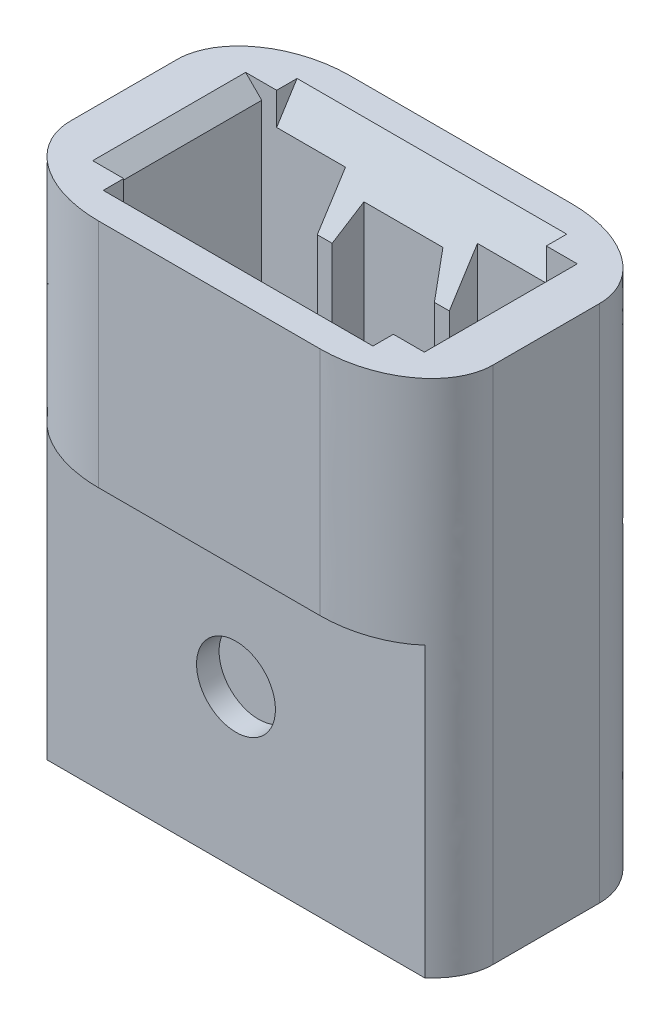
from build123d import *

# Parameters (mm, degrees)
BOSS_EXTRUDE1_DEPTH = 16.383
SKETCH2_R           = 1.2446
CUT_EXTRUDE1_DEPTH  = 20.387164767
SKETCH3_W           = 22.51853113
SKETCH3_H           = 6.510477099
CUT_EXTRUDE2_DEPTH  = 9.0932
SKETCH4_W           = 9.4488
SKETCH4_H           = 4.826
CUT_EXTRUDE3_DEPTH  = 19.127581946
SKETCH5_W           = 4.1656
SKETCH5_H           = 4.826
BOSS_EXTRUDE3_DEPTH = 16.383
CUT_EXTRUDE4_DEPTH  = 9.525
SKETCH7_W           = 6.312279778
SKETCH7_H           = 3.048
CUT_EXTRUDE5_DEPTH  = 9.525
CHAMFER1_SIZE       = 0.508
CUT_EXTRUDE6_DEPTH  = 4.2545


with BuildPart() as part:
    # Sketch1 → Boss-Extrude1 (new body)
    with BuildSketch(Plane(origin=(0, 0, 0), x_dir=(1, 0, 0), z_dir=(0, 1, 0))):
        with BuildLine():
            Line((-6.6675, 1.68275), (-6.6675, -1.68275))
            add(Edge.make_bspline(
                [(-6.6675, -1.68275), (-6.6675, -3.96875), (-3.4925, -3.96875)],
                knots=[0, 0, 0, 1.570796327, 1.570796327, 1.570796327], degree=2, weights=[1, 0.707106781, 1]))
            Line((-3.4925, -3.96875), (3.4925, -3.96875))
            add(Edge.make_bspline(
                [(3.4925, -3.96875), (6.6675, -3.96875), (6.6675, -1.68275)],
                knots=[1.570796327, 1.570796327, 1.570796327, 3.141592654, 3.141592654, 3.141592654], degree=2, weights=[1, 0.707106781, 1]))
            Line((6.6675, -1.68275), (6.6675, 1.68275))
            add(Edge.make_bspline(
                [(6.6675, 1.68275), (6.6675, 3.96875), (3.4925, 3.96875)],
                knots=[3.141592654, 3.141592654, 3.141592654, 4.71238898, 4.71238898, 4.71238898], degree=2, weights=[1, 0.707106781, 1]))
            Line((3.4925, 3.96875), (-3.4925, 3.96875))
            add(Edge.make_bspline(
                [(-3.4925, 3.96875), (-6.6675, 3.96875), (-6.6675, 1.68275)],
                knots=[1.570796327, 1.570796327, 1.570796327, 3.141592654, 3.141592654, 3.141592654], degree=2, weights=[1, 0.707106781, 1]))
        make_face()
    extrude(amount=-BOSS_EXTRUDE1_DEPTH)

    # Sketch2 → Cut-Extrude1 (cut, through all)
    with BuildSketch(Plane.XY.offset(3.96875)):
        with Locations((0, -11.4046)):
            Circle(SKETCH2_R)
    extrude(amount=-CUT_EXTRUDE1_DEPTH, mode=Mode.SUBTRACT)

    # Sketch3 → Cut-Extrude2 (cut)
    with BuildSketch(Plane.XZ.offset(16.383)):
        with Locations((2.3521832, -6.37943855)):
            Rectangle(SKETCH3_W, SKETCH3_H)
    cut_extrude2 = extrude(amount=-CUT_EXTRUDE2_DEPTH, mode=Mode.SUBTRACT)

    # Mirror1: Cut-Extrude2 across plane
    add(cut_extrude2.mirror(Plane.XY), mode=Mode.SUBTRACT)

    # Sketch4 → Cut-Extrude3 (cut, through all)
    with BuildSketch(Plane(origin=(0, 0, 0), x_dir=(1, 0, 0), z_dir=(0, 1, 0))):
        Rectangle(SKETCH4_W, SKETCH4_H)
    extrude(amount=-CUT_EXTRUDE3_DEPTH, mode=Mode.SUBTRACT)

    # Sketch5 → Boss-Extrude3 (add, through all)
    with BuildSketch(Plane(origin=(0, 0, 0), x_dir=(1, 0, 0), z_dir=(0, 1, 0))):
        Rectangle(SKETCH5_W, SKETCH5_H)
    extrude(amount=-BOSS_EXTRUDE3_DEPTH)

    # Sketch6 → Cut-Extrude4 (cut)
    with BuildSketch(Plane(origin=(0, 0, 0), x_dir=(1, 0, 0), z_dir=(0, 1, 0))):
        Polygon((2.492998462, 0), (1.246499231, 2.159), (-1.246499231, 2.159), (-2.492998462, 0), (-1.246499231, -2.159), (1.246499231, -2.159), align=None)
    extrude(amount=-CUT_EXTRUDE4_DEPTH, mode=Mode.SUBTRACT)

    # Sketch7 → Cut-Extrude5 (cut)
    with BuildSketch(Plane(origin=(0, 0, 0), x_dir=(1, 0, 0), z_dir=(0, 1, 0))):
        Rectangle(SKETCH7_W, SKETCH7_H)
    extrude(amount=-CUT_EXTRUDE5_DEPTH, mode=Mode.SUBTRACT)

    # Chamfer1
    chamfer1_edges = [part.edges().sort_by_distance(p)[0] for p in [
        (4.7244, 0, 0),
        (-4.7244, 0, 0),
    ]]
    chamfer(chamfer1_edges, length=CHAMFER1_SIZE)

    # Sketch8 → Cut-Extrude6 (cut, symmetric)
    with BuildSketch(Plane(origin=(0, 0, 0), x_dir=(0, 0, -1), z_dir=(1, 0, 0))):
        Polygon((3.058099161, 0), (1.123164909, 0), (1.123164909, -3.048724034), align=None)
    cut_extrude6 = extrude(amount=CUT_EXTRUDE6_DEPTH, both=True, mode=Mode.SUBTRACT)

    # Mirror2: Cut-Extrude6 across plane
    add(cut_extrude6.mirror(Plane.XY), mode=Mode.SUBTRACT)


solid = part.part
